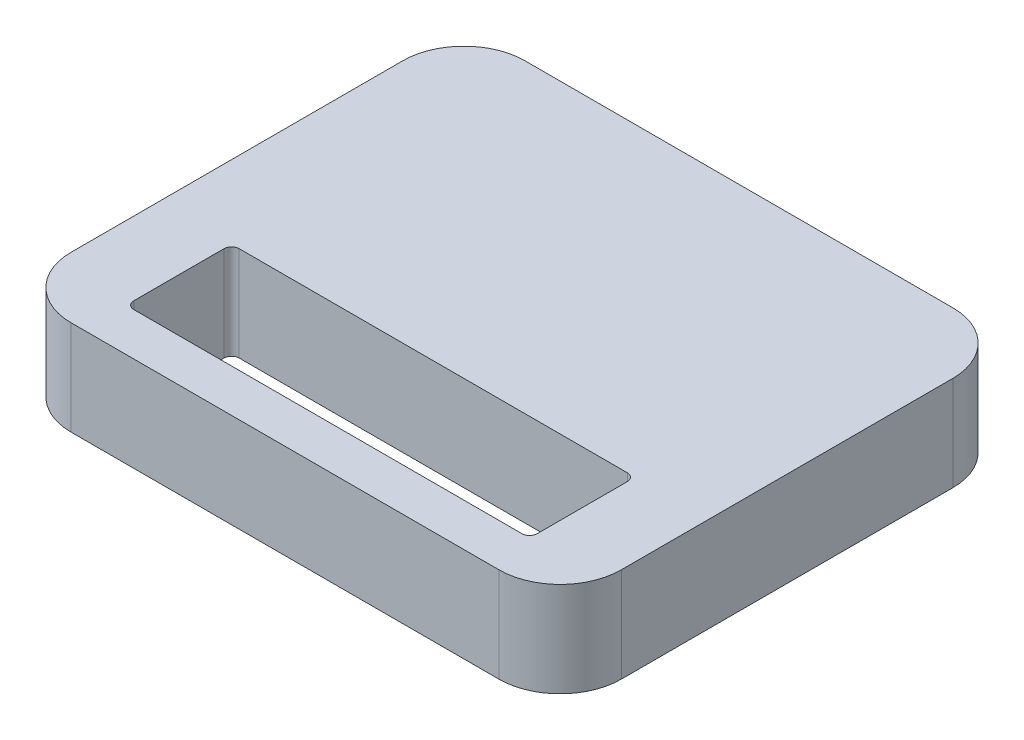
from build123d import *

# Parameters (mm, degrees)
SKETCH1_W           = 36
SKETCH1_H           = 29.7
SKETCH1_W_2         = 26.4
SKETCH1_H_2         = 6.9
BOSS_EXTRUDE1_DEPTH = 6.2
FILLET1_R           = 4
FILLET2_R           = 0.5


with BuildPart() as part:
    # Sketch1 → Boss-Extrude1 (new body)
    with BuildSketch(Plane(origin=(0, 0, 0), x_dir=(1, 0, 0), z_dir=(0, 1, 0))):
        with Locations((0, 8.6)):
            Rectangle(SKETCH1_W, SKETCH1_H)
        Rectangle(SKETCH1_W_2, SKETCH1_H_2, mode=Mode.SUBTRACT)
    extrude(amount=BOSS_EXTRUDE1_DEPTH)

    # Fillet1
    fillet1_edges = [part.edges().sort_by_distance(p)[0] for p in [
        (-18, 3.1, -23.45),
        (18, 3.1, -23.45),
        (18, 3.1, 6.25),
        (-18, 3.1, 6.25),
    ]]
    fillet(fillet1_edges, radius=FILLET1_R)

    # Fillet2
    fillet2_edges = [part.edges().sort_by_distance(p)[0] for p in [
        (13.2, 3.1, 3.45),
        (13.2, 3.1, -3.45),
        (-13.2, 3.1, -3.45),
        (-13.2, 3.1, 3.45),
    ]]
    fillet(fillet2_edges, radius=FILLET2_R)


solid = part.part
